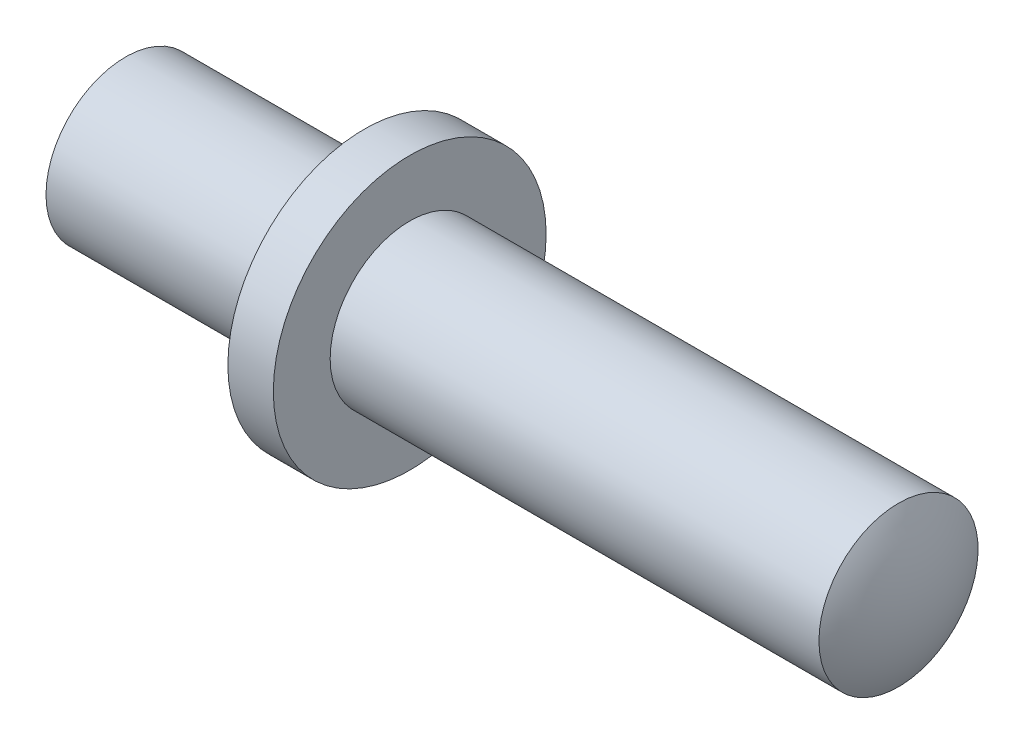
ISO-10303-21;
HEADER;
FILE_DESCRIPTION(('STEP AP214'),'2;1');
FILE_NAME('part.step','',(''),(''),'','','');
FILE_SCHEMA(('AUTOMOTIVE_DESIGN { 1 0 10303 214 1 1 1 1 }'));
ENDSEC;
DATA;
#1=APPLICATION_CONTEXT('core data for automotive mechanical design processes');
#2=APPLICATION_PROTOCOL_DEFINITION('international standard','automotive_design',2000,#1);
#3=PRODUCT_CONTEXT('',#1,'mechanical');
#4=PRODUCT('Part','Part','',(#3));
#5=PRODUCT_RELATED_PRODUCT_CATEGORY('part','',(#4));
#6=PRODUCT_DEFINITION_FORMATION('','',#4);
#7=PRODUCT_DEFINITION_CONTEXT('part definition',#1,'design');
#8=PRODUCT_DEFINITION('design','',#6,#7);
#9=PRODUCT_DEFINITION_SHAPE('','',#8);
#10=(LENGTH_UNIT() NAMED_UNIT(*) SI_UNIT(.MILLI.,.METRE.));
#11=(NAMED_UNIT(*) PLANE_ANGLE_UNIT() SI_UNIT($,.RADIAN.));
#12=(NAMED_UNIT(*) SI_UNIT($,.STERADIAN.) SOLID_ANGLE_UNIT());
#13=UNCERTAINTY_MEASURE_WITH_UNIT(LENGTH_MEASURE(1.E-05),#10,'distance_accuracy_value','');
#14=(GEOMETRIC_REPRESENTATION_CONTEXT(3) GLOBAL_UNCERTAINTY_ASSIGNED_CONTEXT((#13)) GLOBAL_UNIT_ASSIGNED_CONTEXT((#10,
#11,#12)) REPRESENTATION_CONTEXT('',''));
#15=CARTESIAN_POINT('',(0.,0.,0.));
#16=DIRECTION('',(0.,0.,1.));
#17=DIRECTION('',(1.,0.,0.));
#18=AXIS2_PLACEMENT_3D('',#15,#16,#17);
#19=CARTESIAN_POINT('',(66.689275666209,0.,0.));
#20=DIRECTION('',(-1.,0.,0.));
#21=DIRECTION('',(0.,1.,0.));
#22=AXIS2_PLACEMENT_3D('',#19,#20,#21);
#23=SPHERICAL_SURFACE('',#22,13.3493015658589);
#24=CARTESIAN_POINT('',(78.0560629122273,0.,0.));
#25=DIRECTION('',(-1.,0.,0.));
#26=DIRECTION('',(0.,0.,1.));
#27=AXIS2_PLACEMENT_3D('',#24,#25,#26);
#28=CIRCLE('',#27,7.);
#29=CARTESIAN_POINT('',(78.0560629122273,0.,7.));
#30=VERTEX_POINT('',#29);
#31=EDGE_CURVE('E10',#30,#30,#28,.T.);
#32=ORIENTED_EDGE('',*,*,#31,.F.);
#33=EDGE_LOOP('',(#32));
#34=FACE_BOUND('',#33,.T.);
#35=ADVANCED_FACE('F37',(#34),#23,.T.);
#36=CARTESIAN_POINT('',(0.,0.,0.));
#37=DIRECTION('',(-1.,0.,0.));
#38=DIRECTION('',(0.,0.,1.));
#39=AXIS2_PLACEMENT_3D('',#36,#37,#38);
#40=CYLINDRICAL_SURFACE('',#39,7.);
#41=CARTESIAN_POINT('',(35.0560629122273,0.,0.));
#42=DIRECTION('',(-1.,0.,0.));
#43=DIRECTION('',(0.,0.,1.));
#44=AXIS2_PLACEMENT_3D('',#41,#42,#43);
#45=CIRCLE('',#44,7.);
#46=CARTESIAN_POINT('',(35.0560629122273,0.,7.));
#47=VERTEX_POINT('',#46);
#48=EDGE_CURVE('E43',#47,#47,#45,.T.);
#49=ORIENTED_EDGE('',*,*,#48,.F.);
#50=EDGE_LOOP('',(#49));
#51=FACE_BOUND('',#50,.T.);
#52=ORIENTED_EDGE('',*,*,#31,.T.);
#53=EDGE_LOOP('',(#52));
#54=FACE_BOUND('',#53,.T.);
#55=ADVANCED_FACE('F86',(#51,#54),#40,.T.);
#56=CARTESIAN_POINT('',(35.0560629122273,12.,0.));
#57=DIRECTION('',(-1.,0.,0.));
#58=DIRECTION('',(0.,0.,1.));
#59=AXIS2_PLACEMENT_3D('',#56,#57,#58);
#60=PLANE('',#59);
#61=CARTESIAN_POINT('',(35.0560629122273,0.,0.));
#62=DIRECTION('',(-1.,0.,0.));
#63=DIRECTION('',(0.,0.,1.));
#64=AXIS2_PLACEMENT_3D('',#61,#62,#63);
#65=CIRCLE('',#64,12.);
#66=CARTESIAN_POINT('',(35.0560629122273,0.,12.));
#67=VERTEX_POINT('',#66);
#68=EDGE_CURVE('E47',#67,#67,#65,.T.);
#69=ORIENTED_EDGE('',*,*,#68,.F.);
#70=EDGE_LOOP('',(#69));
#71=FACE_BOUND('',#70,.T.);
#72=ORIENTED_EDGE('',*,*,#48,.T.);
#73=EDGE_LOOP('',(#72));
#74=FACE_BOUND('',#73,.T.);
#75=ADVANCED_FACE('F81',(#71,#74),#60,.F.);
#76=CARTESIAN_POINT('',(0.,0.,0.));
#77=DIRECTION('',(-1.,0.,0.));
#78=DIRECTION('',(0.,0.,1.));
#79=AXIS2_PLACEMENT_3D('',#76,#77,#78);
#80=CYLINDRICAL_SURFACE('',#79,12.);
#81=CARTESIAN_POINT('',(31.0560629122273,0.,0.));
#82=DIRECTION('',(-1.,0.,0.));
#83=DIRECTION('',(0.,0.,1.));
#84=AXIS2_PLACEMENT_3D('',#81,#82,#83);
#85=CIRCLE('',#84,12.);
#86=CARTESIAN_POINT('',(31.0560629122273,0.,12.));
#87=VERTEX_POINT('',#86);
#88=EDGE_CURVE('E52',#87,#87,#85,.T.);
#89=ORIENTED_EDGE('',*,*,#88,.F.);
#90=EDGE_LOOP('',(#89));
#91=FACE_BOUND('',#90,.T.);
#92=ORIENTED_EDGE('',*,*,#68,.T.);
#93=EDGE_LOOP('',(#92));
#94=FACE_BOUND('',#93,.T.);
#95=ADVANCED_FACE('F75',(#91,#94),#80,.T.);
#96=CARTESIAN_POINT('',(31.0560629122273,7.,0.));
#97=DIRECTION('',(1.,0.,0.));
#98=DIRECTION('',(0.,0.,-1.));
#99=AXIS2_PLACEMENT_3D('',#96,#97,#98);
#100=PLANE('',#99);
#101=CARTESIAN_POINT('',(31.0560629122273,0.,0.));
#102=DIRECTION('',(-1.,0.,0.));
#103=DIRECTION('',(0.,0.,1.));
#104=AXIS2_PLACEMENT_3D('',#101,#102,#103);
#105=CIRCLE('',#104,7.);
#106=CARTESIAN_POINT('',(31.0560629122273,0.,7.));
#107=VERTEX_POINT('',#106);
#108=EDGE_CURVE('E57',#107,#107,#105,.T.);
#109=ORIENTED_EDGE('',*,*,#108,.F.);
#110=EDGE_LOOP('',(#109));
#111=FACE_BOUND('',#110,.T.);
#112=ORIENTED_EDGE('',*,*,#88,.T.);
#113=EDGE_LOOP('',(#112));
#114=FACE_BOUND('',#113,.T.);
#115=ADVANCED_FACE('F69',(#111,#114),#100,.F.);
#116=CARTESIAN_POINT('',(0.,0.,0.));
#117=DIRECTION('',(-1.,0.,0.));
#118=DIRECTION('',(0.,0.,1.));
#119=AXIS2_PLACEMENT_3D('',#116,#117,#118);
#120=CYLINDRICAL_SURFACE('',#119,7.);
#121=CARTESIAN_POINT('',(10.0560629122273,0.,0.));
#122=DIRECTION('',(-1.,0.,0.));
#123=DIRECTION('',(0.,0.,1.));
#124=AXIS2_PLACEMENT_3D('',#121,#122,#123);
#125=CIRCLE('',#124,7.);
#126=CARTESIAN_POINT('',(10.0560629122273,0.,7.));
#127=VERTEX_POINT('',#126);
#128=EDGE_CURVE('E60',#127,#127,#125,.T.);
#129=ORIENTED_EDGE('',*,*,#128,.F.);
#130=EDGE_LOOP('',(#129));
#131=FACE_BOUND('',#130,.T.);
#132=ORIENTED_EDGE('',*,*,#108,.T.);
#133=EDGE_LOOP('',(#132));
#134=FACE_BOUND('',#133,.T.);
#135=ADVANCED_FACE('F66',(#131,#134),#120,.T.);
#136=CARTESIAN_POINT('',(10.0560629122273,0.,0.));
#137=DIRECTION('',(1.,0.,0.));
#138=DIRECTION('',(0.,0.,-1.));
#139=AXIS2_PLACEMENT_3D('',#136,#137,#138);
#140=PLANE('',#139);
#141=ORIENTED_EDGE('',*,*,#128,.T.);
#142=EDGE_LOOP('',(#141));
#143=FACE_BOUND('',#142,.T.);
#144=ADVANCED_FACE('F64',(#143),#140,.F.);
#145=CLOSED_SHELL('',(#35,#55,#75,#95,#115,#135,#144));
#146=MANIFOLD_SOLID_BREP('B2',#145);
#147=ADVANCED_BREP_SHAPE_REPRESENTATION('',(#18,#146),#14);
#148=SHAPE_DEFINITION_REPRESENTATION(#9,#147);
ENDSEC;
END-ISO-10303-21;
